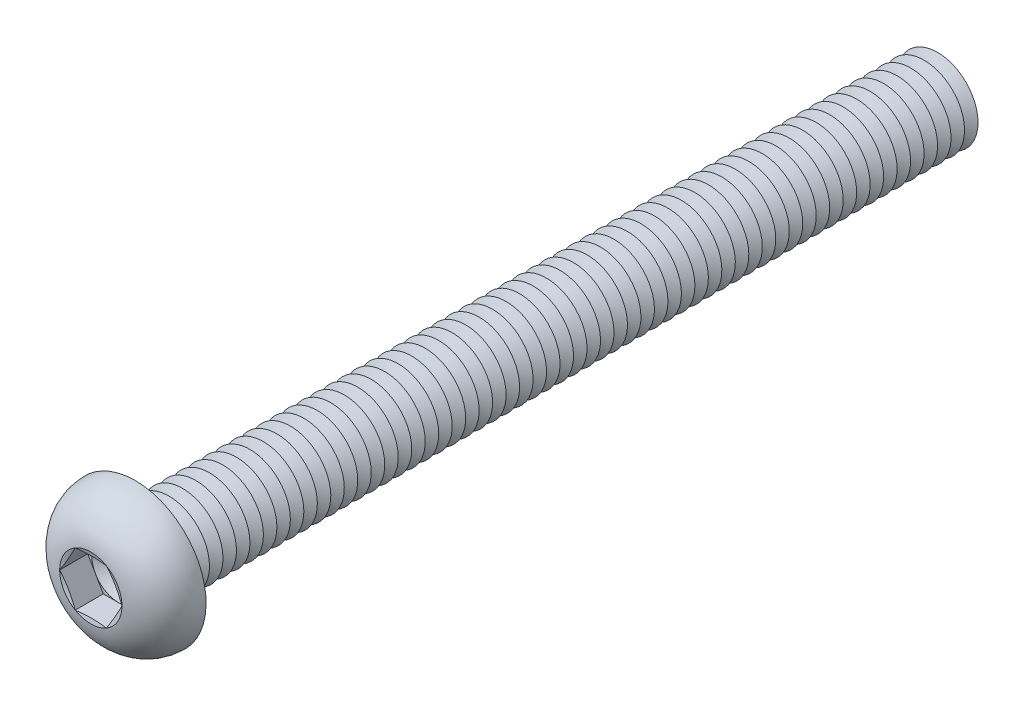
from build123d import *

# Parameters (mm, degrees)
FILLET1_R          = 0.5
LPATTERN1_COUNT    = 60
LPATTERN1_PITCH    = 1
CUT_EXTRUDE1_DEPTH = 2.08


with BuildPart() as part:
    # Sketch1 → Revolve1 (revolve)
    with BuildSketch(Plane(origin=(0, 0, 0), x_dir=(0, 0, -1), z_dir=(1, 0, 0))):
        with BuildLine():
            Line((0, 3), (0, 5.25))
            ThreePointArc((0, 5.25), (-2.210041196, 4.408189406), (-3.3, 2.3094))
            Line((-3.3, 2.3094), (-2.990599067, 1.1547))
            Line((-2.990599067, 1.1547), (-3.3, 1.1547))
            Line((-3.3, 1.1547), (-3.3, 0))
            Line((-3.3, 0), (60, 0))
            Line((60, 0), (60, 3))
            Line((60, 3), (0, 3))
        make_face()
    revolve(axis=Axis((0, 0, -60), (0, 0, 1)))

    # Fillet1
    fillet1_edges = [part.edges().sort_by_distance(p)[0] for p in [
        (0, -3, 0),
    ]]
    fillet(fillet1_edges, radius=FILLET1_R)

    # Sketch2 → Cut-Revolve1 (revolve, cut)
    with BuildSketch(Plane(origin=(0, 0, 0), x_dir=(0, 0, -1), z_dir=(1, 0, 0))):
        Polygon((59.5, 3), (60.5, 3), (60, 2.133974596), align=None)
    cut_revolve1 = revolve(axis=Axis((0, 0, -60), (0, 0, -1)), mode=Mode.SUBTRACT)

    # LPattern1: Cut-Revolve1 ×60
    with Locations(*[(0, 0, i * LPATTERN1_PITCH) for i in range(1, LPATTERN1_COUNT)]):
        add(cut_revolve1, mode=Mode.SUBTRACT)

    # Sketch3 → Cut-Extrude1 (cut)
    with BuildSketch(Plane.XY.offset(3.3)):
        Polygon((1.1547, 1.999999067), (-1.1547, 1.999999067), (-2.3094, 0), (-1.1547, -1.999999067), (1.1547, -1.999999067), (2.3094, 0), align=None)
    extrude(amount=-CUT_EXTRUDE1_DEPTH, mode=Mode.SUBTRACT)

    # Cut-Extrude2 cone 1 section (on through the dimple's axis) → Cut-Extrude2 (revolve, cut)
    with BuildSketch(Plane(origin=(0, 0, 1.22), x_dir=(0, -1, 0), z_dir=(1, 0, 0))):
        Polygon((0, 0), (1.999999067, 0), (0, 1.1547), align=None)
    revolve(axis=Axis((0, 0, 1.22), (0, 0, -1)), mode=Mode.SUBTRACT)


solid = part.part
